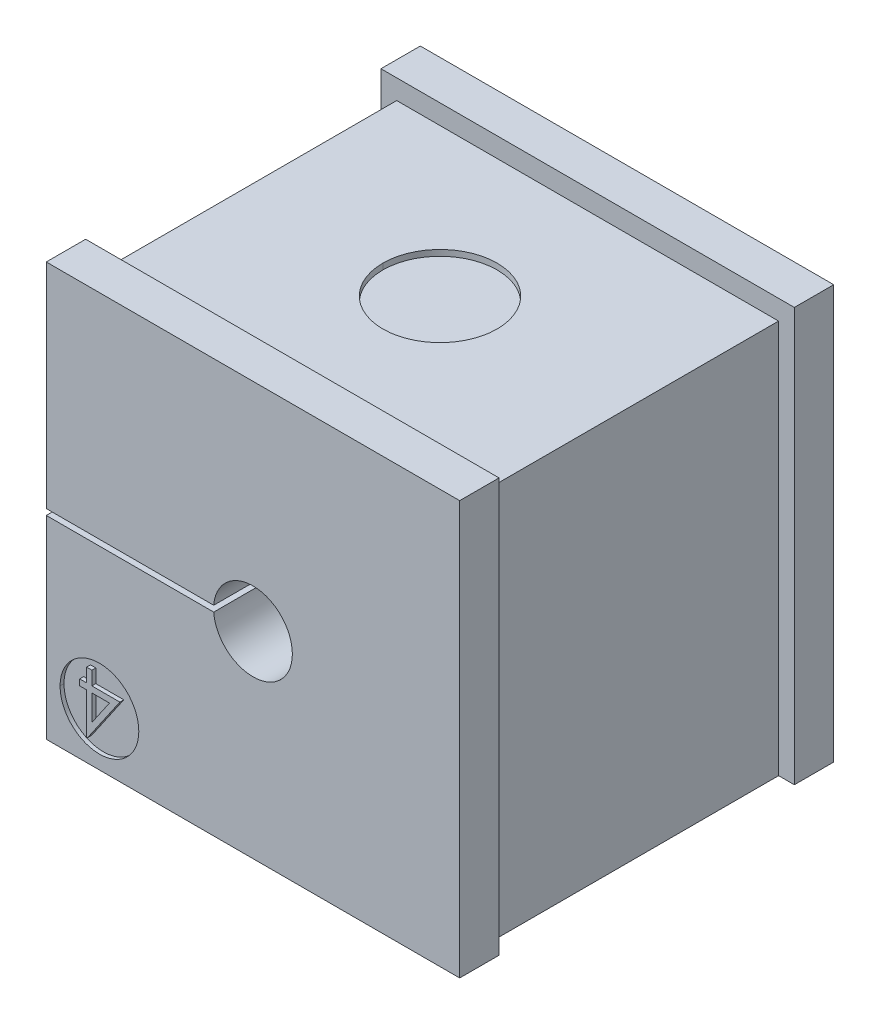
ISO-10303-21;
HEADER;
FILE_DESCRIPTION(('STEP AP214'),'2;1');
FILE_NAME('part.step','',(''),(''),'','','');
FILE_SCHEMA(('AUTOMOTIVE_DESIGN { 1 0 10303 214 1 1 1 1 }'));
ENDSEC;
DATA;
#1=APPLICATION_CONTEXT('core data for automotive mechanical design processes');
#2=APPLICATION_PROTOCOL_DEFINITION('international standard','automotive_design',2000,#1);
#3=PRODUCT_CONTEXT('',#1,'mechanical');
#4=PRODUCT('Part','Part','',(#3));
#5=PRODUCT_RELATED_PRODUCT_CATEGORY('part','',(#4));
#6=PRODUCT_DEFINITION_FORMATION('','',#4);
#7=PRODUCT_DEFINITION_CONTEXT('part definition',#1,'design');
#8=PRODUCT_DEFINITION('design','',#6,#7);
#9=PRODUCT_DEFINITION_SHAPE('','',#8);
#10=(LENGTH_UNIT() NAMED_UNIT(*) SI_UNIT(.MILLI.,.METRE.));
#11=(NAMED_UNIT(*) PLANE_ANGLE_UNIT() SI_UNIT($,.RADIAN.));
#12=(NAMED_UNIT(*) SI_UNIT($,.STERADIAN.) SOLID_ANGLE_UNIT());
#13=UNCERTAINTY_MEASURE_WITH_UNIT(LENGTH_MEASURE(1.E-05),#10,'distance_accuracy_value','');
#14=(GEOMETRIC_REPRESENTATION_CONTEXT(3) GLOBAL_UNCERTAINTY_ASSIGNED_CONTEXT((#13)) GLOBAL_UNIT_ASSIGNED_CONTEXT((#10,
#11,#12)) REPRESENTATION_CONTEXT('',''));
#15=CARTESIAN_POINT('',(0.,0.,0.));
#16=DIRECTION('',(0.,0.,1.));
#17=DIRECTION('',(1.,0.,0.));
#18=AXIS2_PLACEMENT_3D('',#15,#16,#17);
#19=CARTESIAN_POINT('',(2.7,-7.8,9.3));
#20=DIRECTION('',(0.,0.,1.));
#21=DIRECTION('',(1.,0.,0.));
#22=AXIS2_PLACEMENT_3D('',#19,#20,#21);
#23=PLANE('',#22);
#24=DIRECTION('',(-1.,0.,0.));
#25=VECTOR('',#24,1.);
#26=CARTESIAN_POINT('',(3.20961538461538,-7.3,9.3));
#27=LINE('',#26,#25);
#28=CARTESIAN_POINT('',(3.20961538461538,-7.3,9.3));
#29=VERTEX_POINT('',#28);
#30=CARTESIAN_POINT('',(2.31538461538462,-7.3,9.3));
#31=VERTEX_POINT('',#30);
#32=EDGE_CURVE('E769',#29,#31,#27,.T.);
#33=ORIENTED_EDGE('',*,*,#32,.T.);
#34=DIRECTION('',(0.,-1.,0.));
#35=VECTOR('',#34,1.);
#36=CARTESIAN_POINT('',(2.31538461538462,-7.3,9.3));
#37=LINE('',#36,#35);
#38=CARTESIAN_POINT('',(2.31538461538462,-8.60288461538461,9.3));
#39=VERTEX_POINT('',#38);
#40=EDGE_CURVE('E555',#31,#39,#37,.T.);
#41=ORIENTED_EDGE('',*,*,#40,.T.);
#42=DIRECTION('',(0.565883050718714,0.824485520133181,0.));
#43=VECTOR('',#42,1.);
#44=CARTESIAN_POINT('',(2.31538461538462,-8.60288461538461,9.3));
#45=LINE('',#44,#43);
#46=EDGE_CURVE('E9',#39,#29,#45,.T.);
#47=ORIENTED_EDGE('',*,*,#46,.T.);
#48=EDGE_LOOP('',(#33,#41,#47));
#49=FACE_BOUND('',#48,.T.);
#50=ADVANCED_FACE('F15',(#49),#23,.T.);
#51=CARTESIAN_POINT('',(2.31538461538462,-8.60288461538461,9.5));
#52=DIRECTION('',(-0.82448552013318,0.565883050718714,0.));
#53=DIRECTION('',(0.,0.,1.));
#54=AXIS2_PLACEMENT_3D('',#51,#52,#53);
#55=PLANE('',#54);
#56=ORIENTED_EDGE('',*,*,#46,.F.);
#57=DIRECTION('',(0.,0.,-1.));
#58=VECTOR('',#57,1.);
#59=CARTESIAN_POINT('',(2.31538461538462,-8.60288461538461,9.5));
#60=LINE('',#59,#58);
#61=CARTESIAN_POINT('',(2.31538461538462,-8.60288461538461,9.5));
#62=VERTEX_POINT('',#61);
#63=EDGE_CURVE('E25',#62,#39,#60,.T.);
#64=ORIENTED_EDGE('',*,*,#63,.F.);
#65=DIRECTION('',(0.565883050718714,0.824485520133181,0.));
#66=VECTOR('',#65,1.);
#67=CARTESIAN_POINT('',(2.31538461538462,-8.60288461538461,9.5));
#68=LINE('',#67,#66);
#69=CARTESIAN_POINT('',(3.20961538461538,-7.3,9.5));
#70=VERTEX_POINT('',#69);
#71=EDGE_CURVE('E642',#62,#70,#68,.T.);
#72=ORIENTED_EDGE('',*,*,#71,.T.);
#73=DIRECTION('',(0.,0.,-1.));
#74=VECTOR('',#73,1.);
#75=CARTESIAN_POINT('',(3.20961538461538,-7.3,9.5));
#76=LINE('',#75,#74);
#77=EDGE_CURVE('E394',#70,#29,#76,.T.);
#78=ORIENTED_EDGE('',*,*,#77,.T.);
#79=EDGE_LOOP('',(#56,#64,#72,#78));
#80=FACE_BOUND('',#79,.T.);
#81=ADVANCED_FACE('F788',(#80),#55,.T.);
#82=CARTESIAN_POINT('',(2.31538461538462,-7.3,9.5));
#83=DIRECTION('',(1.,0.,0.));
#84=DIRECTION('',(0.,1.,0.));
#85=AXIS2_PLACEMENT_3D('',#82,#83,#84);
#86=PLANE('',#85);
#87=ORIENTED_EDGE('',*,*,#40,.F.);
#88=DIRECTION('',(0.,0.,-1.));
#89=VECTOR('',#88,1.);
#90=CARTESIAN_POINT('',(2.31538461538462,-7.3,9.5));
#91=LINE('',#90,#89);
#92=CARTESIAN_POINT('',(2.31538461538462,-7.3,9.5));
#93=VERTEX_POINT('',#92);
#94=EDGE_CURVE('E18',#93,#31,#91,.T.);
#95=ORIENTED_EDGE('',*,*,#94,.F.);
#96=DIRECTION('',(0.,-1.,0.));
#97=VECTOR('',#96,1.);
#98=CARTESIAN_POINT('',(2.31538461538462,-7.3,9.5));
#99=LINE('',#98,#97);
#100=EDGE_CURVE('E424',#93,#62,#99,.T.);
#101=ORIENTED_EDGE('',*,*,#100,.T.);
#102=ORIENTED_EDGE('',*,*,#63,.T.);
#103=EDGE_LOOP('',(#87,#95,#101,#102));
#104=FACE_BOUND('',#103,.T.);
#105=ADVANCED_FACE('F783',(#104),#86,.T.);
#106=CARTESIAN_POINT('',(3.20961538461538,-7.3,9.5));
#107=DIRECTION('',(0.,-1.,0.));
#108=DIRECTION('',(0.,0.,-1.));
#109=AXIS2_PLACEMENT_3D('',#106,#107,#108);
#110=PLANE('',#109);
#111=ORIENTED_EDGE('',*,*,#32,.F.);
#112=ORIENTED_EDGE('',*,*,#77,.F.);
#113=DIRECTION('',(-1.,0.,0.));
#114=VECTOR('',#113,1.);
#115=CARTESIAN_POINT('',(3.20961538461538,-7.3,9.5));
#116=LINE('',#115,#114);
#117=EDGE_CURVE('E757',#70,#93,#116,.T.);
#118=ORIENTED_EDGE('',*,*,#117,.T.);
#119=ORIENTED_EDGE('',*,*,#94,.T.);
#120=EDGE_LOOP('',(#111,#112,#118,#119));
#121=FACE_BOUND('',#120,.T.);
#122=ADVANCED_FACE('F779',(#121),#110,.T.);
#123=CARTESIAN_POINT('',(2.10084134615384,-9.37692307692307,9.5));
#124=DIRECTION('',(0.,-1.,0.));
#125=DIRECTION('',(0.,0.,-1.));
#126=AXIS2_PLACEMENT_3D('',#123,#124,#125);
#127=PLANE('',#126);
#128=DIRECTION('',(-1.,0.,0.));
#129=VECTOR('',#128,1.);
#130=CARTESIAN_POINT('',(2.10084134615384,-9.37692307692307,9.3));
#131=LINE('',#130,#129);
#132=CARTESIAN_POINT('',(2.10084134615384,-9.37692307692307,9.3));
#133=VERTEX_POINT('',#132);
#134=CARTESIAN_POINT('',(2.04615384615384,-9.37692307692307,9.3));
#135=VERTEX_POINT('',#134);
#136=EDGE_CURVE('E457',#133,#135,#131,.T.);
#137=ORIENTED_EDGE('',*,*,#136,.F.);
#138=DIRECTION('',(0.,0.,-1.));
#139=VECTOR('',#138,1.);
#140=CARTESIAN_POINT('',(2.10084134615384,-9.37692307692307,9.5));
#141=LINE('',#140,#139);
#142=CARTESIAN_POINT('',(2.10084134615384,-9.37692307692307,9.5));
#143=VERTEX_POINT('',#142);
#144=EDGE_CURVE('E423',#143,#133,#141,.T.);
#145=ORIENTED_EDGE('',*,*,#144,.F.);
#146=DIRECTION('',(-1.,0.,0.));
#147=VECTOR('',#146,1.);
#148=CARTESIAN_POINT('',(2.10084134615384,-9.37692307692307,9.5));
#149=LINE('',#148,#147);
#150=CARTESIAN_POINT('',(2.04615384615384,-9.37692307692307,9.5));
#151=VERTEX_POINT('',#150);
#152=EDGE_CURVE('E753',#143,#151,#149,.T.);
#153=ORIENTED_EDGE('',*,*,#152,.T.);
#154=DIRECTION('',(0.,0.,-1.));
#155=VECTOR('',#154,1.);
#156=CARTESIAN_POINT('',(2.04615384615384,-9.37692307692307,9.5));
#157=LINE('',#156,#155);
#158=EDGE_CURVE('E767',#151,#135,#157,.T.);
#159=ORIENTED_EDGE('',*,*,#158,.T.);
#160=EDGE_LOOP('',(#137,#145,#153,#159));
#161=FACE_BOUND('',#160,.T.);
#162=ADVANCED_FACE('F799',(#161),#127,.T.);
#163=CARTESIAN_POINT('',(2.04615384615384,-9.37692307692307,9.5));
#164=DIRECTION('',(-1.,0.,0.));
#165=DIRECTION('',(0.,0.,1.));
#166=AXIS2_PLACEMENT_3D('',#163,#164,#165);
#167=PLANE('',#166);
#168=DIRECTION('',(0.,1.,0.));
#169=VECTOR('',#168,1.);
#170=CARTESIAN_POINT('',(2.04615384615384,-9.37692307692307,9.3));
#171=LINE('',#170,#169);
#172=CARTESIAN_POINT('',(2.04615384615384,-7.3,9.3));
#173=VERTEX_POINT('',#172);
#174=EDGE_CURVE('E512',#135,#173,#171,.T.);
#175=ORIENTED_EDGE('',*,*,#174,.F.);
#176=ORIENTED_EDGE('',*,*,#158,.F.);
#177=DIRECTION('',(0.,1.,0.));
#178=VECTOR('',#177,1.);
#179=CARTESIAN_POINT('',(2.04615384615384,-9.37692307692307,9.5));
#180=LINE('',#179,#178);
#181=CARTESIAN_POINT('',(2.04615384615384,-7.3,9.5));
#182=VERTEX_POINT('',#181);
#183=EDGE_CURVE('E749',#151,#182,#180,.T.);
#184=ORIENTED_EDGE('',*,*,#183,.T.);
#185=DIRECTION('',(0.,0.,-1.));
#186=VECTOR('',#185,1.);
#187=CARTESIAN_POINT('',(2.04615384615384,-7.3,9.5));
#188=LINE('',#187,#186);
#189=EDGE_CURVE('E489',#182,#173,#188,.T.);
#190=ORIENTED_EDGE('',*,*,#189,.T.);
#191=EDGE_LOOP('',(#175,#176,#184,#190));
#192=FACE_BOUND('',#191,.T.);
#193=ADVANCED_FACE('F802',(#192),#167,.T.);
#194=CARTESIAN_POINT('',(2.04615384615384,-7.3,9.5));
#195=DIRECTION('',(0.,-1.,0.));
#196=DIRECTION('',(0.,0.,-1.));
#197=AXIS2_PLACEMENT_3D('',#194,#195,#196);
#198=PLANE('',#197);
#199=DIRECTION('',(-1.,0.,0.));
#200=VECTOR('',#199,1.);
#201=CARTESIAN_POINT('',(2.04615384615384,-7.3,9.3));
#202=LINE('',#201,#200);
#203=CARTESIAN_POINT('',(1.7,-7.3,9.3));
#204=VERTEX_POINT('',#203);
#205=EDGE_CURVE('E520',#173,#204,#202,.T.);
#206=ORIENTED_EDGE('',*,*,#205,.F.);
#207=ORIENTED_EDGE('',*,*,#189,.F.);
#208=DIRECTION('',(-1.,0.,0.));
#209=VECTOR('',#208,1.);
#210=CARTESIAN_POINT('',(2.04615384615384,-7.3,9.5));
#211=LINE('',#210,#209);
#212=CARTESIAN_POINT('',(1.7,-7.3,9.5));
#213=VERTEX_POINT('',#212);
#214=EDGE_CURVE('E598',#182,#213,#211,.T.);
#215=ORIENTED_EDGE('',*,*,#214,.T.);
#216=DIRECTION('',(0.,0.,-1.));
#217=VECTOR('',#216,1.);
#218=CARTESIAN_POINT('',(1.7,-7.3,9.5));
#219=LINE('',#218,#217);
#220=EDGE_CURVE('E486',#213,#204,#219,.T.);
#221=ORIENTED_EDGE('',*,*,#220,.T.);
#222=EDGE_LOOP('',(#206,#207,#215,#221));
#223=FACE_BOUND('',#222,.T.);
#224=ADVANCED_FACE('F806',(#223),#198,.T.);
#225=CARTESIAN_POINT('',(1.7,-7.3,9.5));
#226=DIRECTION('',(-1.,0.,0.));
#227=DIRECTION('',(0.,0.,1.));
#228=AXIS2_PLACEMENT_3D('',#225,#226,#227);
#229=PLANE('',#228);
#230=DIRECTION('',(0.,1.,0.));
#231=VECTOR('',#230,1.);
#232=CARTESIAN_POINT('',(1.7,-7.3,9.3));
#233=LINE('',#232,#231);
#234=CARTESIAN_POINT('',(1.7,-6.99230769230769,9.3));
#235=VERTEX_POINT('',#234);
#236=EDGE_CURVE('E668',#204,#235,#233,.T.);
#237=ORIENTED_EDGE('',*,*,#236,.F.);
#238=ORIENTED_EDGE('',*,*,#220,.F.);
#239=DIRECTION('',(0.,1.,0.));
#240=VECTOR('',#239,1.);
#241=CARTESIAN_POINT('',(1.7,-7.3,9.5));
#242=LINE('',#241,#240);
#243=CARTESIAN_POINT('',(1.7,-6.99230769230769,9.5));
#244=VERTEX_POINT('',#243);
#245=EDGE_CURVE('E587',#213,#244,#242,.T.);
#246=ORIENTED_EDGE('',*,*,#245,.T.);
#247=DIRECTION('',(0.,0.,-1.));
#248=VECTOR('',#247,1.);
#249=CARTESIAN_POINT('',(1.7,-6.99230769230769,9.5));
#250=LINE('',#249,#248);
#251=EDGE_CURVE('E490',#244,#235,#250,.T.);
#252=ORIENTED_EDGE('',*,*,#251,.T.);
#253=EDGE_LOOP('',(#237,#238,#246,#252));
#254=FACE_BOUND('',#253,.T.);
#255=ADVANCED_FACE('F808',(#254),#229,.T.);
#256=CARTESIAN_POINT('',(1.7,-6.99230769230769,9.5));
#257=DIRECTION('',(0.,1.,0.));
#258=DIRECTION('',(1.,0.,0.));
#259=AXIS2_PLACEMENT_3D('',#256,#257,#258);
#260=PLANE('',#259);
#261=DIRECTION('',(1.,0.,0.));
#262=VECTOR('',#261,1.);
#263=CARTESIAN_POINT('',(1.7,-6.99230769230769,9.3));
#264=LINE('',#263,#262);
#265=CARTESIAN_POINT('',(2.04615384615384,-6.99230769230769,9.3));
#266=VERTEX_POINT('',#265);
#267=EDGE_CURVE('E444',#235,#266,#264,.T.);
#268=ORIENTED_EDGE('',*,*,#267,.F.);
#269=ORIENTED_EDGE('',*,*,#251,.F.);
#270=DIRECTION('',(1.,0.,0.));
#271=VECTOR('',#270,1.);
#272=CARTESIAN_POINT('',(1.7,-6.99230769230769,9.5));
#273=LINE('',#272,#271);
#274=CARTESIAN_POINT('',(2.04615384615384,-6.99230769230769,9.5));
#275=VERTEX_POINT('',#274);
#276=EDGE_CURVE('E579',#244,#275,#273,.T.);
#277=ORIENTED_EDGE('',*,*,#276,.T.);
#278=DIRECTION('',(0.,0.,-1.));
#279=VECTOR('',#278,1.);
#280=CARTESIAN_POINT('',(2.04615384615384,-6.99230769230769,9.5));
#281=LINE('',#280,#279);
#282=EDGE_CURVE('E718',#275,#266,#281,.T.);
#283=ORIENTED_EDGE('',*,*,#282,.T.);
#284=EDGE_LOOP('',(#268,#269,#277,#283));
#285=FACE_BOUND('',#284,.T.);
#286=ADVANCED_FACE('F811',(#285),#260,.T.);
#287=CARTESIAN_POINT('',(2.04615384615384,-6.99230769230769,9.5));
#288=DIRECTION('',(-1.,0.,0.));
#289=DIRECTION('',(0.,0.,1.));
#290=AXIS2_PLACEMENT_3D('',#287,#288,#289);
#291=PLANE('',#290);
#292=DIRECTION('',(0.,1.,0.));
#293=VECTOR('',#292,1.);
#294=CARTESIAN_POINT('',(2.04615384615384,-6.99230769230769,9.3));
#295=LINE('',#294,#293);
#296=CARTESIAN_POINT('',(2.04615384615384,-6.3,9.3));
#297=VERTEX_POINT('',#296);
#298=EDGE_CURVE('E439',#266,#297,#295,.T.);
#299=ORIENTED_EDGE('',*,*,#298,.F.);
#300=ORIENTED_EDGE('',*,*,#282,.F.);
#301=DIRECTION('',(0.,1.,0.));
#302=VECTOR('',#301,1.);
#303=CARTESIAN_POINT('',(2.04615384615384,-6.99230769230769,9.5));
#304=LINE('',#303,#302);
#305=CARTESIAN_POINT('',(2.04615384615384,-6.3,9.5));
#306=VERTEX_POINT('',#305);
#307=EDGE_CURVE('E575',#275,#306,#304,.T.);
#308=ORIENTED_EDGE('',*,*,#307,.T.);
#309=DIRECTION('',(0.,0.,-1.));
#310=VECTOR('',#309,1.);
#311=CARTESIAN_POINT('',(2.04615384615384,-6.3,9.5));
#312=LINE('',#311,#310);
#313=EDGE_CURVE('E497',#306,#297,#312,.T.);
#314=ORIENTED_EDGE('',*,*,#313,.T.);
#315=EDGE_LOOP('',(#299,#300,#308,#314));
#316=FACE_BOUND('',#315,.T.);
#317=ADVANCED_FACE('F813',(#316),#291,.T.);
#318=CARTESIAN_POINT('',(2.04615384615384,-6.3,9.5));
#319=DIRECTION('',(0.,1.,0.));
#320=DIRECTION('',(1.,0.,0.));
#321=AXIS2_PLACEMENT_3D('',#318,#319,#320);
#322=PLANE('',#321);
#323=DIRECTION('',(1.,0.,0.));
#324=VECTOR('',#323,1.);
#325=CARTESIAN_POINT('',(2.04615384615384,-6.3,9.3));
#326=LINE('',#325,#324);
#327=CARTESIAN_POINT('',(2.31538461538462,-6.3,9.3));
#328=VERTEX_POINT('',#327);
#329=EDGE_CURVE('E443',#297,#328,#326,.T.);
#330=ORIENTED_EDGE('',*,*,#329,.F.);
#331=ORIENTED_EDGE('',*,*,#313,.F.);
#332=DIRECTION('',(1.,0.,0.));
#333=VECTOR('',#332,1.);
#334=CARTESIAN_POINT('',(2.04615384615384,-6.3,9.5));
#335=LINE('',#334,#333);
#336=CARTESIAN_POINT('',(2.31538461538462,-6.3,9.5));
#337=VERTEX_POINT('',#336);
#338=EDGE_CURVE('E580',#306,#337,#335,.T.);
#339=ORIENTED_EDGE('',*,*,#338,.T.);
#340=DIRECTION('',(0.,0.,-1.));
#341=VECTOR('',#340,1.);
#342=CARTESIAN_POINT('',(2.31538461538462,-6.3,9.5));
#343=LINE('',#342,#341);
#344=EDGE_CURVE('E494',#337,#328,#343,.T.);
#345=ORIENTED_EDGE('',*,*,#344,.T.);
#346=EDGE_LOOP('',(#330,#331,#339,#345));
#347=FACE_BOUND('',#346,.T.);
#348=ADVANCED_FACE('F816',(#347),#322,.T.);
#349=CARTESIAN_POINT('',(2.31538461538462,-6.3,9.5));
#350=DIRECTION('',(1.,0.,0.));
#351=DIRECTION('',(0.,1.,0.));
#352=AXIS2_PLACEMENT_3D('',#349,#350,#351);
#353=PLANE('',#352);
#354=DIRECTION('',(0.,-1.,0.));
#355=VECTOR('',#354,1.);
#356=CARTESIAN_POINT('',(2.31538461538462,-6.3,9.3));
#357=LINE('',#356,#355);
#358=CARTESIAN_POINT('',(2.31538461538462,-6.99230769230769,9.3));
#359=VERTEX_POINT('',#358);
#360=EDGE_CURVE('E678',#328,#359,#357,.T.);
#361=ORIENTED_EDGE('',*,*,#360,.F.);
#362=ORIENTED_EDGE('',*,*,#344,.F.);
#363=DIRECTION('',(0.,-1.,0.));
#364=VECTOR('',#363,1.);
#365=CARTESIAN_POINT('',(2.31538461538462,-6.3,9.5));
#366=LINE('',#365,#364);
#367=CARTESIAN_POINT('',(2.31538461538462,-6.99230769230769,9.5));
#368=VERTEX_POINT('',#367);
#369=EDGE_CURVE('E467',#337,#368,#366,.T.);
#370=ORIENTED_EDGE('',*,*,#369,.T.);
#371=DIRECTION('',(0.,0.,-1.));
#372=VECTOR('',#371,1.);
#373=CARTESIAN_POINT('',(2.31538461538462,-6.99230769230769,9.5));
#374=LINE('',#373,#372);
#375=EDGE_CURVE('E498',#368,#359,#374,.T.);
#376=ORIENTED_EDGE('',*,*,#375,.T.);
#377=EDGE_LOOP('',(#361,#362,#370,#376));
#378=FACE_BOUND('',#377,.T.);
#379=ADVANCED_FACE('F820',(#378),#353,.T.);
#380=CARTESIAN_POINT('',(2.31538461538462,-6.99230769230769,9.5));
#381=DIRECTION('',(0.,1.,0.));
#382=DIRECTION('',(1.,0.,0.));
#383=AXIS2_PLACEMENT_3D('',#380,#381,#382);
#384=PLANE('',#383);
#385=DIRECTION('',(1.,0.,0.));
#386=VECTOR('',#385,1.);
#387=CARTESIAN_POINT('',(2.31538461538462,-6.99230769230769,9.3));
#388=LINE('',#387,#386);
#389=CARTESIAN_POINT('',(3.73846153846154,-6.99230769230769,9.3));
#390=VERTEX_POINT('',#389);
#391=EDGE_CURVE('E682',#359,#390,#388,.T.);
#392=ORIENTED_EDGE('',*,*,#391,.F.);
#393=ORIENTED_EDGE('',*,*,#375,.F.);
#394=DIRECTION('',(1.,0.,0.));
#395=VECTOR('',#394,1.);
#396=CARTESIAN_POINT('',(2.31538461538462,-6.99230769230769,9.5));
#397=LINE('',#396,#395);
#398=CARTESIAN_POINT('',(3.73846153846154,-6.99230769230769,9.5));
#399=VERTEX_POINT('',#398);
#400=EDGE_CURVE('E463',#368,#399,#397,.T.);
#401=ORIENTED_EDGE('',*,*,#400,.T.);
#402=DIRECTION('',(0.,0.,-1.));
#403=VECTOR('',#402,1.);
#404=CARTESIAN_POINT('',(3.73846153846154,-6.99230769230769,9.5));
#405=LINE('',#404,#403);
#406=EDGE_CURVE('E420',#399,#390,#405,.T.);
#407=ORIENTED_EDGE('',*,*,#406,.T.);
#408=EDGE_LOOP('',(#392,#393,#401,#407));
#409=FACE_BOUND('',#408,.T.);
#410=ADVANCED_FACE('F822',(#409),#384,.T.);
#411=CARTESIAN_POINT('',(3.73846153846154,-6.99230769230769,9.5));
#412=DIRECTION('',(0.824332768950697,-0.566105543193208,0.));
#413=DIRECTION('',(0.,0.,-1.));
#414=AXIS2_PLACEMENT_3D('',#411,#412,#413);
#415=PLANE('',#414);
#416=DIRECTION('',(-0.566105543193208,-0.824332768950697,0.));
#417=VECTOR('',#416,1.);
#418=CARTESIAN_POINT('',(3.73846153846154,-6.99230769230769,9.3));
#419=LINE('',#418,#417);
#420=EDGE_CURVE('E453',#390,#133,#419,.T.);
#421=ORIENTED_EDGE('',*,*,#420,.F.);
#422=ORIENTED_EDGE('',*,*,#406,.F.);
#423=DIRECTION('',(-0.566105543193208,-0.824332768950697,0.));
#424=VECTOR('',#423,1.);
#425=CARTESIAN_POINT('',(3.73846153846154,-6.99230769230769,9.5));
#426=LINE('',#425,#424);
#427=EDGE_CURVE('E468',#399,#143,#426,.T.);
#428=ORIENTED_EDGE('',*,*,#427,.T.);
#429=ORIENTED_EDGE('',*,*,#144,.T.);
#430=EDGE_LOOP('',(#421,#422,#428,#429));
#431=FACE_BOUND('',#430,.T.);
#432=ADVANCED_FACE('F825',(#431),#415,.T.);
#433=CARTESIAN_POINT('',(0.,0.,9.5));
#434=DIRECTION('',(0.,0.,-1.));
#435=DIRECTION('',(0.,-1.,0.));
#436=AXIS2_PLACEMENT_3D('',#433,#434,#435);
#437=PLANE('',#436);
#438=ORIENTED_EDGE('',*,*,#117,.F.);
#439=ORIENTED_EDGE('',*,*,#71,.F.);
#440=ORIENTED_EDGE('',*,*,#100,.F.);
#441=EDGE_LOOP('',(#438,#439,#440));
#442=FACE_BOUND('',#441,.T.);
#443=ORIENTED_EDGE('',*,*,#427,.F.);
#444=ORIENTED_EDGE('',*,*,#400,.F.);
#445=ORIENTED_EDGE('',*,*,#369,.F.);
#446=ORIENTED_EDGE('',*,*,#338,.F.);
#447=ORIENTED_EDGE('',*,*,#307,.F.);
#448=ORIENTED_EDGE('',*,*,#276,.F.);
#449=ORIENTED_EDGE('',*,*,#245,.F.);
#450=ORIENTED_EDGE('',*,*,#214,.F.);
#451=ORIENTED_EDGE('',*,*,#183,.F.);
#452=ORIENTED_EDGE('',*,*,#152,.F.);
#453=EDGE_LOOP('',(#443,#444,#445,#446,#447,#448,#449,#450,#451,#452));
#454=FACE_BOUND('',#453,.T.);
#455=ADVANCED_FACE('F786',(#442,#454),#437,.F.);
#456=CARTESIAN_POINT('',(10.5,-0.5,-15.1568542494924));
#457=DIRECTION('',(0.,0.,1.));
#458=DIRECTION('',(1.,0.,0.));
#459=AXIS2_PLACEMENT_3D('',#456,#457,#458);
#460=CYLINDRICAL_SURFACE('',#459,2.);
#461=DIRECTION('',(0.,0.,1.));
#462=VECTOR('',#461,1.);
#463=CARTESIAN_POINT('',(12.5,-0.5,-15.1568542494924));
#464=LINE('',#463,#462);
#465=CARTESIAN_POINT('',(12.5,-0.5,-9.5));
#466=VERTEX_POINT('',#465);
#467=CARTESIAN_POINT('',(12.5,-0.5,9.5));
#468=VERTEX_POINT('',#467);
#469=EDGE_CURVE('E376',#466,#468,#464,.T.);
#470=ORIENTED_EDGE('',*,*,#469,.F.);
#471=CARTESIAN_POINT('',(10.5,-0.5,-9.5));
#472=DIRECTION('',(0.,0.,1.));
#473=DIRECTION('',(-1.,0.,0.));
#474=AXIS2_PLACEMENT_3D('',#471,#472,#473);
#475=CIRCLE('',#474,2.);
#476=CARTESIAN_POINT('',(8.50563293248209,-0.65,-9.5));
#477=VERTEX_POINT('',#476);
#478=EDGE_CURVE('E360',#477,#466,#475,.T.);
#479=ORIENTED_EDGE('',*,*,#478,.F.);
#480=DIRECTION('',(0.,0.,1.));
#481=VECTOR('',#480,1.);
#482=CARTESIAN_POINT('',(8.50563293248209,-0.65,-15.1568542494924));
#483=LINE('',#482,#481);
#484=CARTESIAN_POINT('',(8.50563293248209,-0.65,9.5));
#485=VERTEX_POINT('',#484);
#486=EDGE_CURVE('E485',#477,#485,#483,.T.);
#487=ORIENTED_EDGE('',*,*,#486,.T.);
#488=CARTESIAN_POINT('',(10.5,-0.5,9.5));
#489=DIRECTION('',(0.,0.,1.));
#490=DIRECTION('',(1.,0.,0.));
#491=AXIS2_PLACEMENT_3D('',#488,#489,#490);
#492=CIRCLE('',#491,2.);
#493=EDGE_CURVE('E378',#485,#468,#492,.T.);
#494=ORIENTED_EDGE('',*,*,#493,.T.);
#495=EDGE_LOOP('',(#470,#479,#487,#494));
#496=FACE_BOUND('',#495,.T.);
#497=ADVANCED_FACE('F377',(#496),#460,.F.);
#498=CARTESIAN_POINT('',(2.7,-7.8,9.3));
#499=DIRECTION('',(0.,0.,1.));
#500=DIRECTION('',(1.,0.,0.));
#501=AXIS2_PLACEMENT_3D('',#498,#499,#500);
#502=CYLINDRICAL_SURFACE('',#501,2.);
#503=DIRECTION('',(0.,0.,1.));
#504=VECTOR('',#503,1.);
#505=CARTESIAN_POINT('',(0.7,-7.8,9.3));
#506=LINE('',#505,#504);
#507=CARTESIAN_POINT('',(0.7,-7.8,9.3));
#508=VERTEX_POINT('',#507);
#509=CARTESIAN_POINT('',(0.7,-7.8,9.5));
#510=VERTEX_POINT('',#509);
#511=EDGE_CURVE('E448',#508,#510,#506,.T.);
#512=ORIENTED_EDGE('',*,*,#511,.F.);
#513=CARTESIAN_POINT('',(2.7,-7.8,9.3));
#514=DIRECTION('',(0.,0.,1.));
#515=DIRECTION('',(1.,0.,0.));
#516=AXIS2_PLACEMENT_3D('',#513,#514,#515);
#517=CIRCLE('',#516,2.);
#518=CARTESIAN_POINT('',(4.7,-7.8,9.3));
#519=VERTEX_POINT('',#518);
#520=EDGE_CURVE('E458',#519,#508,#517,.T.);
#521=ORIENTED_EDGE('',*,*,#520,.F.);
#522=DIRECTION('',(0.,0.,1.));
#523=VECTOR('',#522,1.);
#524=CARTESIAN_POINT('',(4.7,-7.8,9.3));
#525=LINE('',#524,#523);
#526=CARTESIAN_POINT('',(4.7,-7.8,9.5));
#527=VERTEX_POINT('',#526);
#528=EDGE_CURVE('E462',#519,#527,#525,.T.);
#529=ORIENTED_EDGE('',*,*,#528,.T.);
#530=CARTESIAN_POINT('',(2.7,-7.8,9.5));
#531=DIRECTION('',(0.,0.,1.));
#532=DIRECTION('',(1.,0.,0.));
#533=AXIS2_PLACEMENT_3D('',#530,#531,#532);
#534=CIRCLE('',#533,2.);
#535=EDGE_CURVE('E373',#527,#510,#534,.T.);
#536=ORIENTED_EDGE('',*,*,#535,.T.);
#537=EDGE_LOOP('',(#512,#521,#529,#536));
#538=FACE_BOUND('',#537,.T.);
#539=ADVANCED_FACE('F834',(#538),#502,.F.);
#540=CARTESIAN_POINT('',(10.5,9.2,0.));
#541=DIRECTION('',(0.,1.,0.));
#542=DIRECTION('',(-1.,0.,0.));
#543=AXIS2_PLACEMENT_3D('',#540,#541,#542);
#544=CYLINDRICAL_SURFACE('',#543,2.9);
#545=DIRECTION('',(0.,1.,0.));
#546=VECTOR('',#545,1.);
#547=CARTESIAN_POINT('',(13.4,9.2,0.));
#548=LINE('',#547,#546);
#549=CARTESIAN_POINT('',(13.4,9.2,0.));
#550=VERTEX_POINT('',#549);
#551=CARTESIAN_POINT('',(13.4,9.5,0.));
#552=VERTEX_POINT('',#551);
#553=EDGE_CURVE('E402',#550,#552,#548,.T.);
#554=ORIENTED_EDGE('',*,*,#553,.F.);
#555=CARTESIAN_POINT('',(10.5,9.2,0.));
#556=DIRECTION('',(0.,1.,0.));
#557=DIRECTION('',(-1.,0.,0.));
#558=AXIS2_PLACEMENT_3D('',#555,#556,#557);
#559=CIRCLE('',#558,2.9);
#560=CARTESIAN_POINT('',(7.6,9.2,0.));
#561=VERTEX_POINT('',#560);
#562=EDGE_CURVE('E372',#561,#550,#559,.T.);
#563=ORIENTED_EDGE('',*,*,#562,.F.);
#564=DIRECTION('',(0.,1.,0.));
#565=VECTOR('',#564,1.);
#566=CARTESIAN_POINT('',(7.6,9.2,0.));
#567=LINE('',#566,#565);
#568=CARTESIAN_POINT('',(7.6,9.5,0.));
#569=VERTEX_POINT('',#568);
#570=EDGE_CURVE('E419',#561,#569,#567,.T.);
#571=ORIENTED_EDGE('',*,*,#570,.T.);
#572=CARTESIAN_POINT('',(10.5,9.5,0.));
#573=DIRECTION('',(0.,-1.,0.));
#574=DIRECTION('',(1.,0.,0.));
#575=AXIS2_PLACEMENT_3D('',#572,#573,#574);
#576=CIRCLE('',#575,2.9);
#577=EDGE_CURVE('E570',#552,#569,#576,.T.);
#578=ORIENTED_EDGE('',*,*,#577,.F.);
#579=EDGE_LOOP('',(#554,#563,#571,#578));
#580=FACE_BOUND('',#579,.T.);
#581=ADVANCED_FACE('F837',(#580),#544,.F.);
#582=CARTESIAN_POINT('',(10.5,9.2,0.));
#583=DIRECTION('',(0.,1.,0.));
#584=DIRECTION('',(1.,0.,0.));
#585=AXIS2_PLACEMENT_3D('',#582,#583,#584);
#586=PLANE('',#585);
#587=ORIENTED_EDGE('',*,*,#562,.T.);
#588=CARTESIAN_POINT('',(10.5,9.2,0.));
#589=DIRECTION('',(0.,1.,0.));
#590=DIRECTION('',(-1.,0.,0.));
#591=AXIS2_PLACEMENT_3D('',#588,#589,#590);
#592=CIRCLE('',#591,2.9);
#593=EDGE_CURVE('E407',#550,#561,#592,.T.);
#594=ORIENTED_EDGE('',*,*,#593,.T.);
#595=EDGE_LOOP('',(#587,#594));
#596=FACE_BOUND('',#595,.T.);
#597=ADVANCED_FACE('F841',(#596),#586,.T.);
#598=CARTESIAN_POINT('',(1.3,0.,7.5));
#599=DIRECTION('',(0.,0.,1.));
#600=DIRECTION('',(1.,0.,0.));
#601=AXIS2_PLACEMENT_3D('',#598,#599,#600);
#602=PLANE('',#601);
#603=DIRECTION('',(0.,1.,0.));
#604=VECTOR('',#603,1.);
#605=CARTESIAN_POINT('',(0.,0.,7.5));
#606=LINE('',#605,#604);
#607=CARTESIAN_POINT('',(0.,-10.5,7.5));
#608=VERTEX_POINT('',#607);
#609=CARTESIAN_POINT('',(0.,-0.65,7.5));
#610=VERTEX_POINT('',#609);
#611=EDGE_CURVE('E717',#608,#610,#606,.T.);
#612=ORIENTED_EDGE('',*,*,#611,.T.);
#613=DIRECTION('',(1.,0.,0.));
#614=VECTOR('',#613,1.);
#615=CARTESIAN_POINT('',(1.3,-0.65,7.5));
#616=LINE('',#615,#614);
#617=CARTESIAN_POINT('',(0.8,-0.65,7.5));
#618=VERTEX_POINT('',#617);
#619=EDGE_CURVE('E508',#610,#618,#616,.T.);
#620=ORIENTED_EDGE('',*,*,#619,.T.);
#621=DIRECTION('',(0.,1.,0.));
#622=VECTOR('',#621,1.);
#623=CARTESIAN_POINT('',(0.8,9.5,7.5));
#624=LINE('',#623,#622);
#625=CARTESIAN_POINT('',(0.8,-10.5,7.5));
#626=VERTEX_POINT('',#625);
#627=EDGE_CURVE('E695',#626,#618,#624,.T.);
#628=ORIENTED_EDGE('',*,*,#627,.F.);
#629=DIRECTION('',(1.,0.,0.));
#630=VECTOR('',#629,1.);
#631=CARTESIAN_POINT('',(1.3,-10.5,7.5));
#632=LINE('',#631,#630);
#633=EDGE_CURVE('E396',#608,#626,#632,.T.);
#634=ORIENTED_EDGE('',*,*,#633,.F.);
#635=EDGE_LOOP('',(#612,#620,#628,#634));
#636=FACE_BOUND('',#635,.T.);
#637=ADVANCED_FACE('F843',(#636),#602,.F.);
#638=CARTESIAN_POINT('',(0.,0.,-7.5));
#639=DIRECTION('',(0.,0.,-1.));
#640=DIRECTION('',(-1.,0.,0.));
#641=AXIS2_PLACEMENT_3D('',#638,#639,#640);
#642=PLANE('',#641);
#643=DIRECTION('',(0.,-1.,0.));
#644=VECTOR('',#643,1.);
#645=CARTESIAN_POINT('',(0.8,9.5,-7.5));
#646=LINE('',#645,#644);
#647=CARTESIAN_POINT('',(0.8,-0.65,-7.5));
#648=VERTEX_POINT('',#647);
#649=CARTESIAN_POINT('',(0.8,-10.5,-7.5));
#650=VERTEX_POINT('',#649);
#651=EDGE_CURVE('E530',#648,#650,#646,.T.);
#652=ORIENTED_EDGE('',*,*,#651,.F.);
#653=DIRECTION('',(-1.,0.,0.));
#654=VECTOR('',#653,1.);
#655=CARTESIAN_POINT('',(0.,-0.65,-7.5));
#656=LINE('',#655,#654);
#657=CARTESIAN_POINT('',(0.,-0.65,-7.5));
#658=VERTEX_POINT('',#657);
#659=EDGE_CURVE('E437',#648,#658,#656,.T.);
#660=ORIENTED_EDGE('',*,*,#659,.T.);
#661=DIRECTION('',(0.,1.,0.));
#662=VECTOR('',#661,1.);
#663=CARTESIAN_POINT('',(0.,0.,-7.5));
#664=LINE('',#663,#662);
#665=CARTESIAN_POINT('',(0.,-10.5,-7.5));
#666=VERTEX_POINT('',#665);
#667=EDGE_CURVE('E723',#666,#658,#664,.T.);
#668=ORIENTED_EDGE('',*,*,#667,.F.);
#669=DIRECTION('',(-1.,0.,0.));
#670=VECTOR('',#669,1.);
#671=CARTESIAN_POINT('',(0.,-10.5,-7.5));
#672=LINE('',#671,#670);
#673=EDGE_CURVE('E412',#650,#666,#672,.T.);
#674=ORIENTED_EDGE('',*,*,#673,.F.);
#675=EDGE_LOOP('',(#652,#660,#668,#674));
#676=FACE_BOUND('',#675,.T.);
#677=ADVANCED_FACE('F846',(#676),#642,.F.);
#678=CARTESIAN_POINT('',(0.,0.,-9.5));
#679=DIRECTION('',(0.,0.,-1.));
#680=DIRECTION('',(0.,-1.,0.));
#681=AXIS2_PLACEMENT_3D('',#678,#679,#680);
#682=PLANE('',#681);
#683=DIRECTION('',(-1.,0.,0.));
#684=VECTOR('',#683,1.);
#685=CARTESIAN_POINT('',(0.,-0.35,-9.5));
#686=LINE('',#685,#684);
#687=CARTESIAN_POINT('',(8.50563293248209,-0.35,-9.5));
#688=VERTEX_POINT('',#687);
#689=CARTESIAN_POINT('',(0.,-0.35,-9.5));
#690=VERTEX_POINT('',#689);
#691=EDGE_CURVE('E524',#688,#690,#686,.T.);
#692=ORIENTED_EDGE('',*,*,#691,.T.);
#693=DIRECTION('',(0.,-1.,0.));
#694=VECTOR('',#693,1.);
#695=CARTESIAN_POINT('',(0.,0.,-9.5));
#696=LINE('',#695,#694);
#697=CARTESIAN_POINT('',(0.,10.5,-9.5));
#698=VERTEX_POINT('',#697);
#699=EDGE_CURVE('E574',#698,#690,#696,.T.);
#700=ORIENTED_EDGE('',*,*,#699,.F.);
#701=DIRECTION('',(-1.,0.,0.));
#702=VECTOR('',#701,1.);
#703=CARTESIAN_POINT('',(0.,10.5,-9.5));
#704=LINE('',#703,#702);
#705=CARTESIAN_POINT('',(21.,10.5,-9.5));
#706=VERTEX_POINT('',#705);
#707=EDGE_CURVE('E590',#706,#698,#704,.T.);
#708=ORIENTED_EDGE('',*,*,#707,.F.);
#709=DIRECTION('',(0.,-1.,0.));
#710=VECTOR('',#709,1.);
#711=CARTESIAN_POINT('',(21.,0.,-9.5));
#712=LINE('',#711,#710);
#713=CARTESIAN_POINT('',(21.,-10.5,-9.5));
#714=VERTEX_POINT('',#713);
#715=EDGE_CURVE('E400',#706,#714,#712,.T.);
#716=ORIENTED_EDGE('',*,*,#715,.T.);
#717=DIRECTION('',(-1.,0.,0.));
#718=VECTOR('',#717,1.);
#719=CARTESIAN_POINT('',(0.,-10.5,-9.5));
#720=LINE('',#719,#718);
#721=CARTESIAN_POINT('',(0.,-10.5,-9.5));
#722=VERTEX_POINT('',#721);
#723=EDGE_CURVE('E699',#714,#722,#720,.T.);
#724=ORIENTED_EDGE('',*,*,#723,.T.);
#725=DIRECTION('',(0.,-1.,0.));
#726=VECTOR('',#725,1.);
#727=CARTESIAN_POINT('',(0.,0.,-9.5));
#728=LINE('',#727,#726);
#729=CARTESIAN_POINT('',(0.,-0.65,-9.5));
#730=VERTEX_POINT('',#729);
#731=EDGE_CURVE('E728',#730,#722,#728,.T.);
#732=ORIENTED_EDGE('',*,*,#731,.F.);
#733=DIRECTION('',(1.,0.,0.));
#734=VECTOR('',#733,1.);
#735=CARTESIAN_POINT('',(0.,-0.65,-9.5));
#736=LINE('',#735,#734);
#737=EDGE_CURVE('E367',#730,#477,#736,.T.);
#738=ORIENTED_EDGE('',*,*,#737,.T.);
#739=ORIENTED_EDGE('',*,*,#478,.T.);
#740=CARTESIAN_POINT('',(10.5,-0.5,-9.5));
#741=DIRECTION('',(0.,0.,1.));
#742=DIRECTION('',(-1.,0.,0.));
#743=AXIS2_PLACEMENT_3D('',#740,#741,#742);
#744=CIRCLE('',#743,2.);
#745=EDGE_CURVE('E365',#466,#688,#744,.T.);
#746=ORIENTED_EDGE('',*,*,#745,.T.);
#747=EDGE_LOOP('',(#692,#700,#708,#716,#724,#732,#738,#739,#746));
#748=FACE_BOUND('',#747,.T.);
#749=ADVANCED_FACE('F363',(#748),#682,.T.);
#750=CARTESIAN_POINT('',(0.,0.,9.5));
#751=DIRECTION('',(0.,0.,-1.));
#752=DIRECTION('',(0.,-1.,0.));
#753=AXIS2_PLACEMENT_3D('',#750,#751,#752);
#754=PLANE('',#753);
#755=ORIENTED_EDGE('',*,*,#535,.F.);
#756=CARTESIAN_POINT('',(2.7,-7.8,9.5));
#757=DIRECTION('',(0.,0.,1.));
#758=DIRECTION('',(1.,0.,0.));
#759=AXIS2_PLACEMENT_3D('',#756,#757,#758);
#760=CIRCLE('',#759,2.);
#761=EDGE_CURVE('E452',#510,#527,#760,.T.);
#762=ORIENTED_EDGE('',*,*,#761,.F.);
#763=EDGE_LOOP('',(#755,#762));
#764=FACE_BOUND('',#763,.T.);
#765=DIRECTION('',(0.,-1.,0.));
#766=VECTOR('',#765,1.);
#767=CARTESIAN_POINT('',(0.,0.,9.5));
#768=LINE('',#767,#766);
#769=CARTESIAN_POINT('',(0.,10.5,9.5));
#770=VERTEX_POINT('',#769);
#771=CARTESIAN_POINT('',(0.,-0.35,9.5));
#772=VERTEX_POINT('',#771);
#773=EDGE_CURVE('E561',#770,#772,#768,.T.);
#774=ORIENTED_EDGE('',*,*,#773,.T.);
#775=DIRECTION('',(-1.,0.,0.));
#776=VECTOR('',#775,1.);
#777=CARTESIAN_POINT('',(0.,-0.35,9.5));
#778=LINE('',#777,#776);
#779=CARTESIAN_POINT('',(8.50563293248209,-0.35,9.5));
#780=VERTEX_POINT('',#779);
#781=EDGE_CURVE('E527',#780,#772,#778,.T.);
#782=ORIENTED_EDGE('',*,*,#781,.F.);
#783=CARTESIAN_POINT('',(10.5,-0.5,9.5));
#784=DIRECTION('',(0.,0.,1.));
#785=DIRECTION('',(1.,0.,0.));
#786=AXIS2_PLACEMENT_3D('',#783,#784,#785);
#787=CIRCLE('',#786,2.);
#788=EDGE_CURVE('E383',#468,#780,#787,.T.);
#789=ORIENTED_EDGE('',*,*,#788,.F.);
#790=ORIENTED_EDGE('',*,*,#493,.F.);
#791=DIRECTION('',(1.,0.,0.));
#792=VECTOR('',#791,1.);
#793=CARTESIAN_POINT('',(0.,-0.65,9.5));
#794=LINE('',#793,#792);
#795=CARTESIAN_POINT('',(0.,-0.65,9.5));
#796=VERTEX_POINT('',#795);
#797=EDGE_CURVE('E482',#796,#485,#794,.T.);
#798=ORIENTED_EDGE('',*,*,#797,.F.);
#799=DIRECTION('',(0.,-1.,0.));
#800=VECTOR('',#799,1.);
#801=CARTESIAN_POINT('',(0.,0.,9.5));
#802=LINE('',#801,#800);
#803=CARTESIAN_POINT('',(0.,-10.5,9.5));
#804=VERTEX_POINT('',#803);
#805=EDGE_CURVE('E714',#796,#804,#802,.T.);
#806=ORIENTED_EDGE('',*,*,#805,.T.);
#807=DIRECTION('',(-1.,0.,0.));
#808=VECTOR('',#807,1.);
#809=CARTESIAN_POINT('',(0.,-10.5,9.5));
#810=LINE('',#809,#808);
#811=CARTESIAN_POINT('',(21.,-10.5,9.5));
#812=VERTEX_POINT('',#811);
#813=EDGE_CURVE('E628',#812,#804,#810,.T.);
#814=ORIENTED_EDGE('',*,*,#813,.F.);
#815=DIRECTION('',(0.,-1.,0.));
#816=VECTOR('',#815,1.);
#817=CARTESIAN_POINT('',(21.,0.,9.5));
#818=LINE('',#817,#816);
#819=CARTESIAN_POINT('',(21.,10.5,9.5));
#820=VERTEX_POINT('',#819);
#821=EDGE_CURVE('E711',#820,#812,#818,.T.);
#822=ORIENTED_EDGE('',*,*,#821,.F.);
#823=DIRECTION('',(-1.,0.,0.));
#824=VECTOR('',#823,1.);
#825=CARTESIAN_POINT('',(0.,10.5,9.5));
#826=LINE('',#825,#824);
#827=EDGE_CURVE('E569',#820,#770,#826,.T.);
#828=ORIENTED_EDGE('',*,*,#827,.T.);
#829=EDGE_LOOP('',(#774,#782,#789,#790,#798,#806,#814,#822,#828));
#830=FACE_BOUND('',#829,.T.);
#831=ADVANCED_FACE('F853',(#764,#830),#754,.F.);
#832=CARTESIAN_POINT('',(0.8,0.,1.75));
#833=DIRECTION('',(1.,0.,0.));
#834=DIRECTION('',(0.,0.,-1.));
#835=AXIS2_PLACEMENT_3D('',#832,#833,#834);
#836=PLANE('',#835);
#837=ORIENTED_EDGE('',*,*,#627,.T.);
#838=DIRECTION('',(0.,0.,-1.));
#839=VECTOR('',#838,1.);
#840=CARTESIAN_POINT('',(0.8,-0.65,1.75));
#841=LINE('',#840,#839);
#842=EDGE_CURVE('E504',#618,#648,#841,.T.);
#843=ORIENTED_EDGE('',*,*,#842,.T.);
#844=ORIENTED_EDGE('',*,*,#651,.T.);
#845=DIRECTION('',(0.,0.,-1.));
#846=VECTOR('',#845,1.);
#847=CARTESIAN_POINT('',(0.8,-10.5,1.75));
#848=LINE('',#847,#846);
#849=EDGE_CURVE('E408',#626,#650,#848,.T.);
#850=ORIENTED_EDGE('',*,*,#849,.F.);
#851=EDGE_LOOP('',(#837,#843,#844,#850));
#852=FACE_BOUND('',#851,.T.);
#853=ADVANCED_FACE('F856',(#852),#836,.F.);
#854=CARTESIAN_POINT('',(0.,0.,9.5));
#855=DIRECTION('',(1.,0.,0.));
#856=DIRECTION('',(0.,1.,0.));
#857=AXIS2_PLACEMENT_3D('',#854,#855,#856);
#858=PLANE('',#857);
#859=ORIENTED_EDGE('',*,*,#667,.T.);
#860=DIRECTION('',(0.,0.,1.));
#861=VECTOR('',#860,1.);
#862=CARTESIAN_POINT('',(0.,-0.65,-9.5));
#863=LINE('',#862,#861);
#864=EDGE_CURVE('E434',#730,#658,#863,.T.);
#865=ORIENTED_EDGE('',*,*,#864,.F.);
#866=ORIENTED_EDGE('',*,*,#731,.T.);
#867=DIRECTION('',(0.,0.,-1.));
#868=VECTOR('',#867,1.);
#869=CARTESIAN_POINT('',(0.,-10.5,9.5));
#870=LINE('',#869,#868);
#871=EDGE_CURVE('E475',#666,#722,#870,.T.);
#872=ORIENTED_EDGE('',*,*,#871,.F.);
#873=EDGE_LOOP('',(#859,#865,#866,#872));
#874=FACE_BOUND('',#873,.T.);
#875=ADVANCED_FACE('F860',(#874),#858,.F.);
#876=CARTESIAN_POINT('',(0.,0.,9.5));
#877=DIRECTION('',(1.,0.,0.));
#878=DIRECTION('',(0.,1.,0.));
#879=AXIS2_PLACEMENT_3D('',#876,#877,#878);
#880=PLANE('',#879);
#881=ORIENTED_EDGE('',*,*,#805,.F.);
#882=DIRECTION('',(0.,0.,1.));
#883=VECTOR('',#882,1.);
#884=CARTESIAN_POINT('',(0.,-0.65,-9.5));
#885=LINE('',#884,#883);
#886=EDGE_CURVE('E516',#610,#796,#885,.T.);
#887=ORIENTED_EDGE('',*,*,#886,.F.);
#888=ORIENTED_EDGE('',*,*,#611,.F.);
#889=DIRECTION('',(0.,0.,-1.));
#890=VECTOR('',#889,1.);
#891=CARTESIAN_POINT('',(0.,-10.5,9.5));
#892=LINE('',#891,#890);
#893=EDGE_CURVE('E401',#804,#608,#892,.T.);
#894=ORIENTED_EDGE('',*,*,#893,.F.);
#895=EDGE_LOOP('',(#881,#887,#888,#894));
#896=FACE_BOUND('',#895,.T.);
#897=ADVANCED_FACE('F864',(#896),#880,.F.);
#898=CARTESIAN_POINT('',(21.,0.,9.5));
#899=DIRECTION('',(1.,0.,0.));
#900=DIRECTION('',(0.,1.,0.));
#901=AXIS2_PLACEMENT_3D('',#898,#899,#900);
#902=PLANE('',#901);
#903=DIRECTION('',(0.,0.,-1.));
#904=VECTOR('',#903,1.);
#905=CARTESIAN_POINT('',(21.,-10.5,9.5));
#906=LINE('',#905,#904);
#907=CARTESIAN_POINT('',(21.,-10.5,7.5));
#908=VERTEX_POINT('',#907);
#909=EDGE_CURVE('E174',#812,#908,#906,.T.);
#910=ORIENTED_EDGE('',*,*,#909,.T.);
#911=DIRECTION('',(0.,1.,0.));
#912=VECTOR('',#911,1.);
#913=CARTESIAN_POINT('',(21.,-10.5,7.5));
#914=LINE('',#913,#912);
#915=CARTESIAN_POINT('',(21.,10.5,7.5));
#916=VERTEX_POINT('',#915);
#917=EDGE_CURVE('E646',#908,#916,#914,.T.);
#918=ORIENTED_EDGE('',*,*,#917,.T.);
#919=DIRECTION('',(0.,0.,-1.));
#920=VECTOR('',#919,1.);
#921=CARTESIAN_POINT('',(21.,10.5,9.5));
#922=LINE('',#921,#920);
#923=EDGE_CURVE('E185',#820,#916,#922,.T.);
#924=ORIENTED_EDGE('',*,*,#923,.F.);
#925=ORIENTED_EDGE('',*,*,#821,.T.);
#926=EDGE_LOOP('',(#910,#918,#924,#925));
#927=FACE_BOUND('',#926,.T.);
#928=ADVANCED_FACE('F871',(#927),#902,.T.);
#929=CARTESIAN_POINT('',(21.,0.,9.5));
#930=DIRECTION('',(1.,0.,0.));
#931=DIRECTION('',(0.,1.,0.));
#932=AXIS2_PLACEMENT_3D('',#929,#930,#931);
#933=PLANE('',#932);
#934=DIRECTION('',(0.,1.,0.));
#935=VECTOR('',#934,1.);
#936=CARTESIAN_POINT('',(21.,-10.5,-7.5));
#937=LINE('',#936,#935);
#938=CARTESIAN_POINT('',(21.,-10.5,-7.5));
#939=VERTEX_POINT('',#938);
#940=CARTESIAN_POINT('',(21.,10.5,-7.5));
#941=VERTEX_POINT('',#940);
#942=EDGE_CURVE('E623',#939,#941,#937,.T.);
#943=ORIENTED_EDGE('',*,*,#942,.F.);
#944=DIRECTION('',(0.,0.,-1.));
#945=VECTOR('',#944,1.);
#946=CARTESIAN_POINT('',(21.,-10.5,9.5));
#947=LINE('',#946,#945);
#948=EDGE_CURVE('E629',#939,#714,#947,.T.);
#949=ORIENTED_EDGE('',*,*,#948,.T.);
#950=ORIENTED_EDGE('',*,*,#715,.F.);
#951=DIRECTION('',(0.,0.,-1.));
#952=VECTOR('',#951,1.);
#953=CARTESIAN_POINT('',(21.,10.5,9.5));
#954=LINE('',#953,#952);
#955=EDGE_CURVE('E194',#941,#706,#954,.T.);
#956=ORIENTED_EDGE('',*,*,#955,.F.);
#957=EDGE_LOOP('',(#943,#949,#950,#956));
#958=FACE_BOUND('',#957,.T.);
#959=ADVANCED_FACE('F875',(#958),#933,.T.);
#960=CARTESIAN_POINT('',(0.,-10.5,9.5));
#961=DIRECTION('',(0.,-1.,0.));
#962=DIRECTION('',(0.,0.,-1.));
#963=AXIS2_PLACEMENT_3D('',#960,#961,#962);
#964=PLANE('',#963);
#965=ORIENTED_EDGE('',*,*,#849,.T.);
#966=ORIENTED_EDGE('',*,*,#673,.T.);
#967=ORIENTED_EDGE('',*,*,#871,.T.);
#968=ORIENTED_EDGE('',*,*,#723,.F.);
#969=ORIENTED_EDGE('',*,*,#948,.F.);
#970=DIRECTION('',(1.,0.,0.));
#971=VECTOR('',#970,1.);
#972=CARTESIAN_POINT('',(21.,-10.5,-7.5));
#973=LINE('',#972,#971);
#974=CARTESIAN_POINT('',(20.2,-10.5,-7.5));
#975=VERTEX_POINT('',#974);
#976=EDGE_CURVE('E429',#975,#939,#973,.T.);
#977=ORIENTED_EDGE('',*,*,#976,.F.);
#978=DIRECTION('',(0.,0.,-1.));
#979=VECTOR('',#978,1.);
#980=CARTESIAN_POINT('',(20.2,-10.5,1.75));
#981=LINE('',#980,#979);
#982=CARTESIAN_POINT('',(20.2,-10.5,7.5));
#983=VERTEX_POINT('',#982);
#984=EDGE_CURVE('E413',#983,#975,#981,.T.);
#985=ORIENTED_EDGE('',*,*,#984,.F.);
#986=DIRECTION('',(-1.,0.,0.));
#987=VECTOR('',#986,1.);
#988=CARTESIAN_POINT('',(19.7,-10.5,7.5));
#989=LINE('',#988,#987);
#990=EDGE_CURVE('E649',#908,#983,#989,.T.);
#991=ORIENTED_EDGE('',*,*,#990,.F.);
#992=ORIENTED_EDGE('',*,*,#909,.F.);
#993=ORIENTED_EDGE('',*,*,#813,.T.);
#994=ORIENTED_EDGE('',*,*,#893,.T.);
#995=ORIENTED_EDGE('',*,*,#633,.T.);
#996=EDGE_LOOP('',(#965,#966,#967,#968,#969,#977,#985,#991,#992,#993,#994,#995));
#997=FACE_BOUND('',#996,.T.);
#998=ADVANCED_FACE('F878',(#997),#964,.T.);
#999=CARTESIAN_POINT('',(20.2,-10.5,-5.5));
#1000=DIRECTION('',(1.,0.,0.));
#1001=DIRECTION('',(0.,1.,0.));
#1002=AXIS2_PLACEMENT_3D('',#999,#1000,#1001);
#1003=PLANE('',#1002);
#1004=ORIENTED_EDGE('',*,*,#984,.T.);
#1005=DIRECTION('',(0.,1.,0.));
#1006=VECTOR('',#1005,1.);
#1007=CARTESIAN_POINT('',(20.2,9.5,-7.5));
#1008=LINE('',#1007,#1006);
#1009=CARTESIAN_POINT('',(20.2,9.5,-7.5));
#1010=VERTEX_POINT('',#1009);
#1011=EDGE_CURVE('E425',#975,#1010,#1008,.T.);
#1012=ORIENTED_EDGE('',*,*,#1011,.T.);
#1013=DIRECTION('',(0.,0.,1.));
#1014=VECTOR('',#1013,1.);
#1015=CARTESIAN_POINT('',(20.2,9.5,-5.5));
#1016=LINE('',#1015,#1014);
#1017=CARTESIAN_POINT('',(20.2,9.5,7.5));
#1018=VERTEX_POINT('',#1017);
#1019=EDGE_CURVE('E686',#1010,#1018,#1016,.T.);
#1020=ORIENTED_EDGE('',*,*,#1019,.T.);
#1021=DIRECTION('',(0.,-1.,0.));
#1022=VECTOR('',#1021,1.);
#1023=CARTESIAN_POINT('',(20.2,9.5,7.5));
#1024=LINE('',#1023,#1022);
#1025=EDGE_CURVE('E655',#1018,#983,#1024,.T.);
#1026=ORIENTED_EDGE('',*,*,#1025,.T.);
#1027=EDGE_LOOP('',(#1004,#1012,#1020,#1026));
#1028=FACE_BOUND('',#1027,.T.);
#1029=ADVANCED_FACE('F893',(#1028),#1003,.T.);
#1030=CARTESIAN_POINT('',(0.,10.5,9.5));
#1031=DIRECTION('',(0.,-1.,0.));
#1032=DIRECTION('',(0.,0.,-1.));
#1033=AXIS2_PLACEMENT_3D('',#1030,#1031,#1032);
#1034=PLANE('',#1033);
#1035=DIRECTION('',(-1.,0.,0.));
#1036=VECTOR('',#1035,1.);
#1037=CARTESIAN_POINT('',(0.,10.5,-7.5));
#1038=LINE('',#1037,#1036);
#1039=CARTESIAN_POINT('',(0.,10.5,-7.5));
#1040=VERTEX_POINT('',#1039);
#1041=EDGE_CURVE('E633',#941,#1040,#1038,.T.);
#1042=ORIENTED_EDGE('',*,*,#1041,.F.);
#1043=ORIENTED_EDGE('',*,*,#955,.T.);
#1044=ORIENTED_EDGE('',*,*,#707,.T.);
#1045=DIRECTION('',(0.,0.,-1.));
#1046=VECTOR('',#1045,1.);
#1047=CARTESIAN_POINT('',(0.,10.5,9.5));
#1048=LINE('',#1047,#1046);
#1049=EDGE_CURVE('E594',#1040,#698,#1048,.T.);
#1050=ORIENTED_EDGE('',*,*,#1049,.F.);
#1051=EDGE_LOOP('',(#1042,#1043,#1044,#1050));
#1052=FACE_BOUND('',#1051,.T.);
#1053=ADVANCED_FACE('F883',(#1052),#1034,.F.);
#1054=CARTESIAN_POINT('',(0.,10.5,9.5));
#1055=DIRECTION('',(0.,-1.,0.));
#1056=DIRECTION('',(0.,0.,-1.));
#1057=AXIS2_PLACEMENT_3D('',#1054,#1055,#1056);
#1058=PLANE('',#1057);
#1059=ORIENTED_EDGE('',*,*,#923,.T.);
#1060=DIRECTION('',(1.,0.,0.));
#1061=VECTOR('',#1060,1.);
#1062=CARTESIAN_POINT('',(1.3,10.5,7.5));
#1063=LINE('',#1062,#1061);
#1064=CARTESIAN_POINT('',(0.,10.5,7.5));
#1065=VERTEX_POINT('',#1064);
#1066=EDGE_CURVE('E639',#1065,#916,#1063,.T.);
#1067=ORIENTED_EDGE('',*,*,#1066,.F.);
#1068=DIRECTION('',(0.,0.,-1.));
#1069=VECTOR('',#1068,1.);
#1070=CARTESIAN_POINT('',(0.,10.5,9.5));
#1071=LINE('',#1070,#1069);
#1072=EDGE_CURVE('E566',#770,#1065,#1071,.T.);
#1073=ORIENTED_EDGE('',*,*,#1072,.F.);
#1074=ORIENTED_EDGE('',*,*,#827,.F.);
#1075=EDGE_LOOP('',(#1059,#1067,#1073,#1074));
#1076=FACE_BOUND('',#1075,.T.);
#1077=ADVANCED_FACE('F879',(#1076),#1058,.F.);
#1078=CARTESIAN_POINT('',(0.,9.5,7.5));
#1079=DIRECTION('',(0.,-1.,0.));
#1080=DIRECTION('',(0.,0.,-1.));
#1081=AXIS2_PLACEMENT_3D('',#1078,#1079,#1080);
#1082=PLANE('',#1081);
#1083=CARTESIAN_POINT('',(10.5,9.5,0.));
#1084=DIRECTION('',(0.,-1.,0.));
#1085=DIRECTION('',(1.,0.,0.));
#1086=AXIS2_PLACEMENT_3D('',#1083,#1084,#1085);
#1087=CIRCLE('',#1086,2.9);
#1088=EDGE_CURVE('E406',#569,#552,#1087,.T.);
#1089=ORIENTED_EDGE('',*,*,#1088,.T.);
#1090=ORIENTED_EDGE('',*,*,#577,.T.);
#1091=EDGE_LOOP('',(#1089,#1090));
#1092=FACE_BOUND('',#1091,.T.);
#1093=DIRECTION('',(1.,0.,0.));
#1094=VECTOR('',#1093,1.);
#1095=CARTESIAN_POINT('',(0.,9.5,7.5));
#1096=LINE('',#1095,#1094);
#1097=CARTESIAN_POINT('',(0.8,9.5,7.5));
#1098=VERTEX_POINT('',#1097);
#1099=EDGE_CURVE('E659',#1098,#1018,#1096,.T.);
#1100=ORIENTED_EDGE('',*,*,#1099,.T.);
#1101=ORIENTED_EDGE('',*,*,#1019,.F.);
#1102=DIRECTION('',(1.,0.,0.));
#1103=VECTOR('',#1102,1.);
#1104=CARTESIAN_POINT('',(0.,9.5,-7.5));
#1105=LINE('',#1104,#1103);
#1106=CARTESIAN_POINT('',(0.8,9.5,-7.5));
#1107=VERTEX_POINT('',#1106);
#1108=EDGE_CURVE('E430',#1107,#1010,#1105,.T.);
#1109=ORIENTED_EDGE('',*,*,#1108,.F.);
#1110=DIRECTION('',(0.,0.,-1.));
#1111=VECTOR('',#1110,1.);
#1112=CARTESIAN_POINT('',(0.8,9.5,1.75));
#1113=LINE('',#1112,#1111);
#1114=EDGE_CURVE('E613',#1098,#1107,#1113,.T.);
#1115=ORIENTED_EDGE('',*,*,#1114,.F.);
#1116=EDGE_LOOP('',(#1100,#1101,#1109,#1115));
#1117=FACE_BOUND('',#1116,.T.);
#1118=ADVANCED_FACE('F882',(#1092,#1117),#1082,.F.);
#1119=CARTESIAN_POINT('',(2.7,-7.8,9.3));
#1120=DIRECTION('',(0.,0.,1.));
#1121=DIRECTION('',(1.,0.,0.));
#1122=AXIS2_PLACEMENT_3D('',#1119,#1120,#1121);
#1123=PLANE('',#1122);
#1124=ORIENTED_EDGE('',*,*,#420,.T.);
#1125=ORIENTED_EDGE('',*,*,#136,.T.);
#1126=ORIENTED_EDGE('',*,*,#174,.T.);
#1127=ORIENTED_EDGE('',*,*,#205,.T.);
#1128=ORIENTED_EDGE('',*,*,#236,.T.);
#1129=ORIENTED_EDGE('',*,*,#267,.T.);
#1130=ORIENTED_EDGE('',*,*,#298,.T.);
#1131=ORIENTED_EDGE('',*,*,#329,.T.);
#1132=ORIENTED_EDGE('',*,*,#360,.T.);
#1133=ORIENTED_EDGE('',*,*,#391,.T.);
#1134=EDGE_LOOP('',(#1124,#1125,#1126,#1127,#1128,#1129,#1130,#1131,#1132,#1133));
#1135=FACE_BOUND('',#1134,.T.);
#1136=ORIENTED_EDGE('',*,*,#520,.T.);
#1137=CARTESIAN_POINT('',(2.7,-7.8,9.3));
#1138=DIRECTION('',(0.,0.,1.));
#1139=DIRECTION('',(1.,0.,0.));
#1140=AXIS2_PLACEMENT_3D('',#1137,#1138,#1139);
#1141=CIRCLE('',#1140,2.);
#1142=EDGE_CURVE('E433',#508,#519,#1141,.T.);
#1143=ORIENTED_EDGE('',*,*,#1142,.T.);
#1144=EDGE_LOOP('',(#1136,#1143));
#1145=FACE_BOUND('',#1144,.T.);
#1146=ADVANCED_FACE('F886',(#1135,#1145),#1123,.T.);
#1147=CARTESIAN_POINT('',(1.3,0.,7.5));
#1148=DIRECTION('',(0.,0.,1.));
#1149=DIRECTION('',(1.,0.,0.));
#1150=AXIS2_PLACEMENT_3D('',#1147,#1148,#1149);
#1151=PLANE('',#1150);
#1152=DIRECTION('',(0.,1.,0.));
#1153=VECTOR('',#1152,1.);
#1154=CARTESIAN_POINT('',(0.8,9.5,7.5));
#1155=LINE('',#1154,#1153);
#1156=CARTESIAN_POINT('',(0.8,-0.35,7.5));
#1157=VERTEX_POINT('',#1156);
#1158=EDGE_CURVE('E609',#1157,#1098,#1155,.T.);
#1159=ORIENTED_EDGE('',*,*,#1158,.F.);
#1160=DIRECTION('',(-1.,0.,0.));
#1161=VECTOR('',#1160,1.);
#1162=CARTESIAN_POINT('',(1.3,-0.35,7.5));
#1163=LINE('',#1162,#1161);
#1164=CARTESIAN_POINT('',(0.,-0.35,7.5));
#1165=VERTEX_POINT('',#1164);
#1166=EDGE_CURVE('E538',#1157,#1165,#1163,.T.);
#1167=ORIENTED_EDGE('',*,*,#1166,.T.);
#1168=DIRECTION('',(0.,1.,0.));
#1169=VECTOR('',#1168,1.);
#1170=CARTESIAN_POINT('',(0.,0.,7.5));
#1171=LINE('',#1170,#1169);
#1172=EDGE_CURVE('E554',#1165,#1065,#1171,.T.);
#1173=ORIENTED_EDGE('',*,*,#1172,.T.);
#1174=ORIENTED_EDGE('',*,*,#1066,.T.);
#1175=ORIENTED_EDGE('',*,*,#917,.F.);
#1176=ORIENTED_EDGE('',*,*,#990,.T.);
#1177=ORIENTED_EDGE('',*,*,#1025,.F.);
#1178=ORIENTED_EDGE('',*,*,#1099,.F.);
#1179=EDGE_LOOP('',(#1159,#1167,#1173,#1174,#1175,#1176,#1177,#1178));
#1180=FACE_BOUND('',#1179,.T.);
#1181=ADVANCED_FACE('F897',(#1180),#1151,.F.);
#1182=CARTESIAN_POINT('',(0.,0.,-7.5));
#1183=DIRECTION('',(0.,0.,-1.));
#1184=DIRECTION('',(-1.,0.,0.));
#1185=AXIS2_PLACEMENT_3D('',#1182,#1183,#1184);
#1186=PLANE('',#1185);
#1187=DIRECTION('',(0.,1.,0.));
#1188=VECTOR('',#1187,1.);
#1189=CARTESIAN_POINT('',(0.,0.,-7.5));
#1190=LINE('',#1189,#1188);
#1191=CARTESIAN_POINT('',(0.,-0.35,-7.5));
#1192=VERTEX_POINT('',#1191);
#1193=EDGE_CURVE('E583',#1192,#1040,#1190,.T.);
#1194=ORIENTED_EDGE('',*,*,#1193,.F.);
#1195=DIRECTION('',(1.,0.,0.));
#1196=VECTOR('',#1195,1.);
#1197=CARTESIAN_POINT('',(0.,-0.35,-7.5));
#1198=LINE('',#1197,#1196);
#1199=CARTESIAN_POINT('',(0.8,-0.35,-7.5));
#1200=VERTEX_POINT('',#1199);
#1201=EDGE_CURVE('E546',#1192,#1200,#1198,.T.);
#1202=ORIENTED_EDGE('',*,*,#1201,.T.);
#1203=DIRECTION('',(0.,-1.,0.));
#1204=VECTOR('',#1203,1.);
#1205=CARTESIAN_POINT('',(0.8,9.5,-7.5));
#1206=LINE('',#1205,#1204);
#1207=EDGE_CURVE('E604',#1107,#1200,#1206,.T.);
#1208=ORIENTED_EDGE('',*,*,#1207,.F.);
#1209=ORIENTED_EDGE('',*,*,#1108,.T.);
#1210=ORIENTED_EDGE('',*,*,#1011,.F.);
#1211=ORIENTED_EDGE('',*,*,#976,.T.);
#1212=ORIENTED_EDGE('',*,*,#942,.T.);
#1213=ORIENTED_EDGE('',*,*,#1041,.T.);
#1214=EDGE_LOOP('',(#1194,#1202,#1208,#1209,#1210,#1211,#1212,#1213));
#1215=FACE_BOUND('',#1214,.T.);
#1216=ADVANCED_FACE('F904',(#1215),#1186,.F.);
#1217=CARTESIAN_POINT('',(0.8,0.,1.75));
#1218=DIRECTION('',(1.,0.,0.));
#1219=DIRECTION('',(0.,0.,-1.));
#1220=AXIS2_PLACEMENT_3D('',#1217,#1218,#1219);
#1221=PLANE('',#1220);
#1222=ORIENTED_EDGE('',*,*,#1207,.T.);
#1223=DIRECTION('',(0.,0.,1.));
#1224=VECTOR('',#1223,1.);
#1225=CARTESIAN_POINT('',(0.8,-0.35,1.75));
#1226=LINE('',#1225,#1224);
#1227=EDGE_CURVE('E541',#1200,#1157,#1226,.T.);
#1228=ORIENTED_EDGE('',*,*,#1227,.T.);
#1229=ORIENTED_EDGE('',*,*,#1158,.T.);
#1230=ORIENTED_EDGE('',*,*,#1114,.T.);
#1231=EDGE_LOOP('',(#1222,#1228,#1229,#1230));
#1232=FACE_BOUND('',#1231,.T.);
#1233=ADVANCED_FACE('F908',(#1232),#1221,.F.);
#1234=CARTESIAN_POINT('',(0.,0.,9.5));
#1235=DIRECTION('',(1.,0.,0.));
#1236=DIRECTION('',(0.,1.,0.));
#1237=AXIS2_PLACEMENT_3D('',#1234,#1235,#1236);
#1238=PLANE('',#1237);
#1239=ORIENTED_EDGE('',*,*,#699,.T.);
#1240=DIRECTION('',(0.,0.,1.));
#1241=VECTOR('',#1240,1.);
#1242=CARTESIAN_POINT('',(0.,-0.35,-9.5));
#1243=LINE('',#1242,#1241);
#1244=EDGE_CURVE('E550',#690,#1192,#1243,.T.);
#1245=ORIENTED_EDGE('',*,*,#1244,.T.);
#1246=ORIENTED_EDGE('',*,*,#1193,.T.);
#1247=ORIENTED_EDGE('',*,*,#1049,.T.);
#1248=EDGE_LOOP('',(#1239,#1245,#1246,#1247));
#1249=FACE_BOUND('',#1248,.T.);
#1250=ADVANCED_FACE('F913',(#1249),#1238,.F.);
#1251=CARTESIAN_POINT('',(0.,0.,9.5));
#1252=DIRECTION('',(1.,0.,0.));
#1253=DIRECTION('',(0.,1.,0.));
#1254=AXIS2_PLACEMENT_3D('',#1251,#1252,#1253);
#1255=PLANE('',#1254);
#1256=ORIENTED_EDGE('',*,*,#1172,.F.);
#1257=DIRECTION('',(0.,0.,1.));
#1258=VECTOR('',#1257,1.);
#1259=CARTESIAN_POINT('',(0.,-0.35,-9.5));
#1260=LINE('',#1259,#1258);
#1261=EDGE_CURVE('E534',#1165,#772,#1260,.T.);
#1262=ORIENTED_EDGE('',*,*,#1261,.T.);
#1263=ORIENTED_EDGE('',*,*,#773,.F.);
#1264=ORIENTED_EDGE('',*,*,#1072,.T.);
#1265=EDGE_LOOP('',(#1256,#1262,#1263,#1264));
#1266=FACE_BOUND('',#1265,.T.);
#1267=ADVANCED_FACE('F916',(#1266),#1255,.F.);
#1268=CARTESIAN_POINT('',(0.,-0.35,-9.5));
#1269=DIRECTION('',(0.,1.,0.));
#1270=DIRECTION('',(1.,0.,0.));
#1271=AXIS2_PLACEMENT_3D('',#1268,#1269,#1270);
#1272=PLANE('',#1271);
#1273=ORIENTED_EDGE('',*,*,#691,.F.);
#1274=DIRECTION('',(0.,0.,-1.));
#1275=VECTOR('',#1274,1.);
#1276=CARTESIAN_POINT('',(8.50563293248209,-0.35,-15.1568542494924));
#1277=LINE('',#1276,#1275);
#1278=EDGE_CURVE('E388',#780,#688,#1277,.T.);
#1279=ORIENTED_EDGE('',*,*,#1278,.F.);
#1280=ORIENTED_EDGE('',*,*,#781,.T.);
#1281=ORIENTED_EDGE('',*,*,#1261,.F.);
#1282=ORIENTED_EDGE('',*,*,#1166,.F.);
#1283=ORIENTED_EDGE('',*,*,#1227,.F.);
#1284=ORIENTED_EDGE('',*,*,#1201,.F.);
#1285=ORIENTED_EDGE('',*,*,#1244,.F.);
#1286=EDGE_LOOP('',(#1273,#1279,#1280,#1281,#1282,#1283,#1284,#1285));
#1287=FACE_BOUND('',#1286,.T.);
#1288=ADVANCED_FACE('F918',(#1287),#1272,.F.);
#1289=CARTESIAN_POINT('',(0.,-0.65,-9.5));
#1290=DIRECTION('',(0.,-1.,0.));
#1291=DIRECTION('',(0.,0.,-1.));
#1292=AXIS2_PLACEMENT_3D('',#1289,#1290,#1291);
#1293=PLANE('',#1292);
#1294=ORIENTED_EDGE('',*,*,#797,.T.);
#1295=ORIENTED_EDGE('',*,*,#486,.F.);
#1296=ORIENTED_EDGE('',*,*,#737,.F.);
#1297=ORIENTED_EDGE('',*,*,#864,.T.);
#1298=ORIENTED_EDGE('',*,*,#659,.F.);
#1299=ORIENTED_EDGE('',*,*,#842,.F.);
#1300=ORIENTED_EDGE('',*,*,#619,.F.);
#1301=ORIENTED_EDGE('',*,*,#886,.T.);
#1302=EDGE_LOOP('',(#1294,#1295,#1296,#1297,#1298,#1299,#1300,#1301));
#1303=FACE_BOUND('',#1302,.T.);
#1304=ADVANCED_FACE('F921',(#1303),#1293,.F.);
#1305=CARTESIAN_POINT('',(10.5,9.2,0.));
#1306=DIRECTION('',(0.,1.,0.));
#1307=DIRECTION('',(-1.,0.,0.));
#1308=AXIS2_PLACEMENT_3D('',#1305,#1306,#1307);
#1309=CYLINDRICAL_SURFACE('',#1308,2.9);
#1310=ORIENTED_EDGE('',*,*,#593,.F.);
#1311=ORIENTED_EDGE('',*,*,#553,.T.);
#1312=ORIENTED_EDGE('',*,*,#1088,.F.);
#1313=ORIENTED_EDGE('',*,*,#570,.F.);
#1314=EDGE_LOOP('',(#1310,#1311,#1312,#1313));
#1315=FACE_BOUND('',#1314,.T.);
#1316=ADVANCED_FACE('F925',(#1315),#1309,.F.);
#1317=CARTESIAN_POINT('',(2.7,-7.8,9.3));
#1318=DIRECTION('',(0.,0.,1.));
#1319=DIRECTION('',(1.,0.,0.));
#1320=AXIS2_PLACEMENT_3D('',#1317,#1318,#1319);
#1321=CYLINDRICAL_SURFACE('',#1320,2.);
#1322=ORIENTED_EDGE('',*,*,#1142,.F.);
#1323=ORIENTED_EDGE('',*,*,#511,.T.);
#1324=ORIENTED_EDGE('',*,*,#761,.T.);
#1325=ORIENTED_EDGE('',*,*,#528,.F.);
#1326=EDGE_LOOP('',(#1322,#1323,#1324,#1325));
#1327=FACE_BOUND('',#1326,.T.);
#1328=ADVANCED_FACE('F935',(#1327),#1321,.F.);
#1329=CARTESIAN_POINT('',(10.5,-0.5,-15.1568542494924));
#1330=DIRECTION('',(0.,0.,1.));
#1331=DIRECTION('',(1.,0.,0.));
#1332=AXIS2_PLACEMENT_3D('',#1329,#1330,#1331);
#1333=CYLINDRICAL_SURFACE('',#1332,2.);
#1334=ORIENTED_EDGE('',*,*,#745,.F.);
#1335=ORIENTED_EDGE('',*,*,#469,.T.);
#1336=ORIENTED_EDGE('',*,*,#788,.T.);
#1337=ORIENTED_EDGE('',*,*,#1278,.T.);
#1338=EDGE_LOOP('',(#1334,#1335,#1336,#1337));
#1339=FACE_BOUND('',#1338,.T.);
#1340=ADVANCED_FACE('F386',(#1339),#1333,.F.);
#1341=CLOSED_SHELL('',(#50,#81,#105,#122,#162,#193,#224,#255,#286,#317,#348,#379,#410,#432,#455,
#497,#539,#581,#597,#637,#677,#749,#831,#853,#875,#897,#928,#959,#998,#1029,#1053,#1077,#1118,
#1146,#1181,#1216,#1233,#1250,#1267,#1288,#1304,#1316,#1328,#1340));
#1342=MANIFOLD_SOLID_BREP('B1',#1341);
#1343=ADVANCED_BREP_SHAPE_REPRESENTATION('',(#18,#1342),#14);
#1344=SHAPE_DEFINITION_REPRESENTATION(#9,#1343);
ENDSEC;
END-ISO-10303-21;
